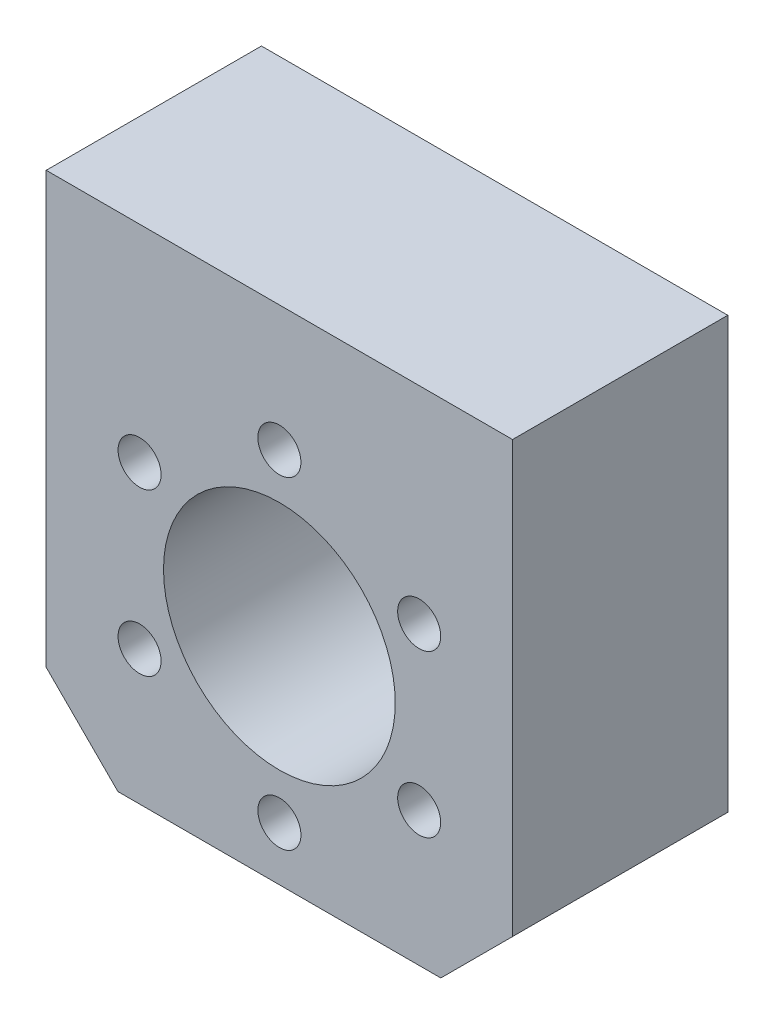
ISO-10303-21;
HEADER;
FILE_DESCRIPTION(('STEP AP214'),'2;1');
FILE_NAME('part.step','',(''),(''),'','','');
FILE_SCHEMA(('AUTOMOTIVE_DESIGN { 1 0 10303 214 1 1 1 1 }'));
ENDSEC;
DATA;
#1=APPLICATION_CONTEXT('core data for automotive mechanical design processes');
#2=APPLICATION_PROTOCOL_DEFINITION('international standard','automotive_design',2000,#1);
#3=PRODUCT_CONTEXT('',#1,'mechanical');
#4=PRODUCT('Part','Part','',(#3));
#5=PRODUCT_RELATED_PRODUCT_CATEGORY('part','',(#4));
#6=PRODUCT_DEFINITION_FORMATION('','',#4);
#7=PRODUCT_DEFINITION_CONTEXT('part definition',#1,'design');
#8=PRODUCT_DEFINITION('design','',#6,#7);
#9=PRODUCT_DEFINITION_SHAPE('','',#8);
#10=(LENGTH_UNIT() NAMED_UNIT(*) SI_UNIT(.MILLI.,.METRE.));
#11=(NAMED_UNIT(*) PLANE_ANGLE_UNIT() SI_UNIT($,.RADIAN.));
#12=(NAMED_UNIT(*) SI_UNIT($,.STERADIAN.) SOLID_ANGLE_UNIT());
#13=UNCERTAINTY_MEASURE_WITH_UNIT(LENGTH_MEASURE(1.E-05),#10,'distance_accuracy_value','');
#14=(GEOMETRIC_REPRESENTATION_CONTEXT(3) GLOBAL_UNCERTAINTY_ASSIGNED_CONTEXT((#13)) GLOBAL_UNIT_ASSIGNED_CONTEXT((#10,
#11,#12)) REPRESENTATION_CONTEXT('',''));
#15=CARTESIAN_POINT('',(0.,0.,0.));
#16=DIRECTION('',(0.,0.,1.));
#17=DIRECTION('',(1.,0.,0.));
#18=AXIS2_PLACEMENT_3D('',#15,#16,#17);
#19=CARTESIAN_POINT('',(12.5283289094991,-24.235127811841,0.));
#20=DIRECTION('',(0.,0.,1.));
#21=DIRECTION('',(1.,0.,0.));
#22=AXIS2_PLACEMENT_3D('',#19,#20,#21);
#23=PLANE('',#22);
#24=CARTESIAN_POINT('',(12.5283289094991,-29.235127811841,0.));
#25=DIRECTION('',(0.,0.,-1.));
#26=DIRECTION('',(-1.,0.,0.));
#27=AXIS2_PLACEMENT_3D('',#24,#25,#26);
#28=CIRCLE('',#27,16.15);
#29=CARTESIAN_POINT('',(-3.62167109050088,-29.235127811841,0.));
#30=VERTEX_POINT('',#29);
#31=EDGE_CURVE('E125',#30,#30,#28,.F.);
#32=ORIENTED_EDGE('',*,*,#31,.T.);
#33=EDGE_LOOP('',(#32));
#34=FACE_BOUND('',#33,.T.);
#35=CARTESIAN_POINT('',(12.5283289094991,-6.73512781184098,0.));
#36=DIRECTION('',(0.,0.,1.));
#37=DIRECTION('',(1.,0.,0.));
#38=AXIS2_PLACEMENT_3D('',#35,#36,#37);
#39=CIRCLE('',#38,3.);
#40=CARTESIAN_POINT('',(15.5283289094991,-6.73512781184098,0.));
#41=VERTEX_POINT('',#40);
#42=EDGE_CURVE('E145',#41,#41,#39,.T.);
#43=ORIENTED_EDGE('',*,*,#42,.T.);
#44=EDGE_LOOP('',(#43));
#45=FACE_BOUND('',#44,.T.);
#46=CARTESIAN_POINT('',(32.013900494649,-17.985127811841,0.));
#47=DIRECTION('',(0.,0.,1.));
#48=DIRECTION('',(1.,0.,0.));
#49=AXIS2_PLACEMENT_3D('',#46,#47,#48);
#50=CIRCLE('',#49,3.);
#51=CARTESIAN_POINT('',(35.013900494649,-17.985127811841,0.));
#52=VERTEX_POINT('',#51);
#53=EDGE_CURVE('E148',#52,#52,#50,.T.);
#54=ORIENTED_EDGE('',*,*,#53,.T.);
#55=EDGE_LOOP('',(#54));
#56=FACE_BOUND('',#55,.T.);
#57=CARTESIAN_POINT('',(-6.95724267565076,-17.985127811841,0.));
#58=DIRECTION('',(0.,0.,1.));
#59=DIRECTION('',(1.,0.,0.));
#60=AXIS2_PLACEMENT_3D('',#57,#58,#59);
#61=CIRCLE('',#60,3.);
#62=CARTESIAN_POINT('',(-3.95724267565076,-17.985127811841,0.));
#63=VERTEX_POINT('',#62);
#64=EDGE_CURVE('E151',#63,#63,#61,.T.);
#65=ORIENTED_EDGE('',*,*,#64,.T.);
#66=EDGE_LOOP('',(#65));
#67=FACE_BOUND('',#66,.T.);
#68=CARTESIAN_POINT('',(-6.95724267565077,-40.485127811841,0.));
#69=DIRECTION('',(0.,0.,1.));
#70=DIRECTION('',(1.,0.,0.));
#71=AXIS2_PLACEMENT_3D('',#68,#69,#70);
#72=CIRCLE('',#71,3.);
#73=CARTESIAN_POINT('',(-3.95724267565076,-40.485127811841,0.));
#74=VERTEX_POINT('',#73);
#75=EDGE_CURVE('E154',#74,#74,#72,.T.);
#76=ORIENTED_EDGE('',*,*,#75,.T.);
#77=EDGE_LOOP('',(#76));
#78=FACE_BOUND('',#77,.T.);
#79=CARTESIAN_POINT('',(12.5283289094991,-51.735127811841,0.));
#80=DIRECTION('',(0.,0.,1.));
#81=DIRECTION('',(1.,0.,0.));
#82=AXIS2_PLACEMENT_3D('',#79,#80,#81);
#83=CIRCLE('',#82,2.99999999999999);
#84=CARTESIAN_POINT('',(15.5283289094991,-51.735127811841,0.));
#85=VERTEX_POINT('',#84);
#86=EDGE_CURVE('E156',#85,#85,#83,.T.);
#87=ORIENTED_EDGE('',*,*,#86,.T.);
#88=EDGE_LOOP('',(#87));
#89=FACE_BOUND('',#88,.T.);
#90=CARTESIAN_POINT('',(32.013900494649,-40.485127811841,0.));
#91=DIRECTION('',(0.,0.,1.));
#92=DIRECTION('',(1.,0.,0.));
#93=AXIS2_PLACEMENT_3D('',#90,#91,#92);
#94=CIRCLE('',#93,3.);
#95=CARTESIAN_POINT('',(35.013900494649,-40.485127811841,0.));
#96=VERTEX_POINT('',#95);
#97=EDGE_CURVE('E20',#96,#96,#94,.T.);
#98=ORIENTED_EDGE('',*,*,#97,.T.);
#99=EDGE_LOOP('',(#98));
#100=FACE_BOUND('',#99,.T.);
#101=DIRECTION('',(1.,0.,0.));
#102=VECTOR('',#101,1.);
#103=CARTESIAN_POINT('',(45.0283289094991,-59.235127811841,0.));
#104=LINE('',#103,#102);
#105=CARTESIAN_POINT('',(-9.97167109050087,-59.235127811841,0.));
#106=VERTEX_POINT('',#105);
#107=CARTESIAN_POINT('',(35.0283289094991,-59.235127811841,0.));
#108=VERTEX_POINT('',#107);
#109=EDGE_CURVE('E107',#106,#108,#104,.T.);
#110=ORIENTED_EDGE('',*,*,#109,.F.);
#111=DIRECTION('',(0.707106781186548,-0.707106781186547,0.));
#112=VECTOR('',#111,1.);
#113=CARTESIAN_POINT('',(-14.9716710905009,-54.235127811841,0.));
#114=LINE('',#113,#112);
#115=CARTESIAN_POINT('',(-19.9716710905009,-49.235127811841,0.));
#116=VERTEX_POINT('',#115);
#117=EDGE_CURVE('E59',#116,#106,#114,.T.);
#118=ORIENTED_EDGE('',*,*,#117,.F.);
#119=DIRECTION('',(0.,1.,0.));
#120=VECTOR('',#119,1.);
#121=CARTESIAN_POINT('',(-19.9716710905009,-59.235127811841,0.));
#122=LINE('',#121,#120);
#123=CARTESIAN_POINT('',(-19.9716710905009,10.764872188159,0.));
#124=VERTEX_POINT('',#123);
#125=EDGE_CURVE('E100',#124,#116,#122,.F.);
#126=ORIENTED_EDGE('',*,*,#125,.F.);
#127=DIRECTION('',(1.,0.,0.));
#128=VECTOR('',#127,1.);
#129=CARTESIAN_POINT('',(-19.9716710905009,10.764872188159,0.));
#130=LINE('',#129,#128);
#131=CARTESIAN_POINT('',(45.0283289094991,10.764872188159,0.));
#132=VERTEX_POINT('',#131);
#133=EDGE_CURVE('E87',#132,#124,#130,.F.);
#134=ORIENTED_EDGE('',*,*,#133,.F.);
#135=DIRECTION('',(0.,1.,0.));
#136=VECTOR('',#135,1.);
#137=CARTESIAN_POINT('',(45.0283289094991,10.764872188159,0.));
#138=LINE('',#137,#136);
#139=CARTESIAN_POINT('',(45.0283289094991,-49.235127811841,0.));
#140=VERTEX_POINT('',#139);
#141=EDGE_CURVE('E85',#140,#132,#138,.T.);
#142=ORIENTED_EDGE('',*,*,#141,.F.);
#143=DIRECTION('',(0.707106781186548,0.707106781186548,0.));
#144=VECTOR('',#143,1.);
#145=CARTESIAN_POINT('',(40.0283289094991,-54.235127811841,0.));
#146=LINE('',#145,#144);
#147=EDGE_CURVE('E74',#108,#140,#146,.T.);
#148=ORIENTED_EDGE('',*,*,#147,.F.);
#149=EDGE_LOOP('',(#110,#118,#126,#134,#142,#148));
#150=FACE_BOUND('',#149,.T.);
#151=ADVANCED_FACE('F16',(#34,#45,#56,#67,#78,#89,#100,#150),#23,.F.);
#152=CARTESIAN_POINT('',(40.0283289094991,-54.235127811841,0.));
#153=DIRECTION('',(0.707106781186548,-0.707106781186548,0.));
#154=DIRECTION('',(0.707106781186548,0.707106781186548,0.));
#155=AXIS2_PLACEMENT_3D('',#152,#153,#154);
#156=PLANE('',#155);
#157=ORIENTED_EDGE('',*,*,#147,.T.);
#158=DIRECTION('',(0.,0.,-1.));
#159=VECTOR('',#158,1.);
#160=CARTESIAN_POINT('',(45.0283289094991,-49.235127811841,0.));
#161=LINE('',#160,#159);
#162=CARTESIAN_POINT('',(45.0283289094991,-49.235127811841,30.));
#163=VERTEX_POINT('',#162);
#164=EDGE_CURVE('E78',#163,#140,#161,.T.);
#165=ORIENTED_EDGE('',*,*,#164,.F.);
#166=DIRECTION('',(0.707106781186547,0.707106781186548,0.));
#167=VECTOR('',#166,1.);
#168=CARTESIAN_POINT('',(35.0283289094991,-59.235127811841,30.));
#169=LINE('',#168,#167);
#170=CARTESIAN_POINT('',(35.0283289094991,-59.235127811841,30.));
#171=VERTEX_POINT('',#170);
#172=EDGE_CURVE('E55',#171,#163,#169,.T.);
#173=ORIENTED_EDGE('',*,*,#172,.F.);
#174=DIRECTION('',(0.,0.,-1.));
#175=VECTOR('',#174,1.);
#176=CARTESIAN_POINT('',(35.0283289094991,-59.235127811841,0.));
#177=LINE('',#176,#175);
#178=EDGE_CURVE('E80',#108,#171,#177,.F.);
#179=ORIENTED_EDGE('',*,*,#178,.F.);
#180=EDGE_LOOP('',(#157,#165,#173,#179));
#181=FACE_BOUND('',#180,.T.);
#182=ADVANCED_FACE('F76',(#181),#156,.T.);
#183=CARTESIAN_POINT('',(45.0283289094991,10.764872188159,0.));
#184=DIRECTION('',(1.,0.,0.));
#185=DIRECTION('',(0.,0.,-1.));
#186=AXIS2_PLACEMENT_3D('',#183,#184,#185);
#187=PLANE('',#186);
#188=DIRECTION('',(0.,0.,1.));
#189=VECTOR('',#188,1.);
#190=CARTESIAN_POINT('',(45.0283289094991,10.764872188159,0.));
#191=LINE('',#190,#189);
#192=CARTESIAN_POINT('',(45.0283289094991,10.764872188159,30.));
#193=VERTEX_POINT('',#192);
#194=EDGE_CURVE('E90',#193,#132,#191,.F.);
#195=ORIENTED_EDGE('',*,*,#194,.F.);
#196=DIRECTION('',(0.,1.,0.));
#197=VECTOR('',#196,1.);
#198=CARTESIAN_POINT('',(45.0283289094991,-24.235127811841,30.));
#199=LINE('',#198,#197);
#200=EDGE_CURVE('E94',#163,#193,#199,.T.);
#201=ORIENTED_EDGE('',*,*,#200,.F.);
#202=ORIENTED_EDGE('',*,*,#164,.T.);
#203=ORIENTED_EDGE('',*,*,#141,.T.);
#204=EDGE_LOOP('',(#195,#201,#202,#203));
#205=FACE_BOUND('',#204,.T.);
#206=ADVANCED_FACE('F92',(#205),#187,.T.);
#207=CARTESIAN_POINT('',(-19.9716710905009,10.764872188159,0.));
#208=DIRECTION('',(0.,1.,0.));
#209=DIRECTION('',(0.,0.,1.));
#210=AXIS2_PLACEMENT_3D('',#207,#208,#209);
#211=PLANE('',#210);
#212=ORIENTED_EDGE('',*,*,#133,.T.);
#213=DIRECTION('',(0.,0.,1.));
#214=VECTOR('',#213,1.);
#215=CARTESIAN_POINT('',(-19.9716710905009,10.764872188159,0.));
#216=LINE('',#215,#214);
#217=CARTESIAN_POINT('',(-19.9716710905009,10.764872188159,30.));
#218=VERTEX_POINT('',#217);
#219=EDGE_CURVE('E98',#218,#124,#216,.F.);
#220=ORIENTED_EDGE('',*,*,#219,.F.);
#221=DIRECTION('',(1.,0.,0.));
#222=VECTOR('',#221,1.);
#223=CARTESIAN_POINT('',(12.5283289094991,10.764872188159,30.));
#224=LINE('',#223,#222);
#225=EDGE_CURVE('E121',#193,#218,#224,.F.);
#226=ORIENTED_EDGE('',*,*,#225,.F.);
#227=ORIENTED_EDGE('',*,*,#194,.T.);
#228=EDGE_LOOP('',(#212,#220,#226,#227));
#229=FACE_BOUND('',#228,.T.);
#230=ADVANCED_FACE('F242',(#229),#211,.T.);
#231=CARTESIAN_POINT('',(-19.9716710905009,-59.235127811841,0.));
#232=DIRECTION('',(-1.,0.,0.));
#233=DIRECTION('',(0.,0.,1.));
#234=AXIS2_PLACEMENT_3D('',#231,#232,#233);
#235=PLANE('',#234);
#236=ORIENTED_EDGE('',*,*,#219,.T.);
#237=ORIENTED_EDGE('',*,*,#125,.T.);
#238=DIRECTION('',(0.,0.,1.));
#239=VECTOR('',#238,1.);
#240=CARTESIAN_POINT('',(-19.9716710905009,-49.235127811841,0.));
#241=LINE('',#240,#239);
#242=CARTESIAN_POINT('',(-19.9716710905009,-49.235127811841,30.));
#243=VERTEX_POINT('',#242);
#244=EDGE_CURVE('E102',#243,#116,#241,.F.);
#245=ORIENTED_EDGE('',*,*,#244,.F.);
#246=DIRECTION('',(0.,1.,0.));
#247=VECTOR('',#246,1.);
#248=CARTESIAN_POINT('',(-19.9716710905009,-24.235127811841,30.));
#249=LINE('',#248,#247);
#250=EDGE_CURVE('E118',#218,#243,#249,.F.);
#251=ORIENTED_EDGE('',*,*,#250,.F.);
#252=EDGE_LOOP('',(#236,#237,#245,#251));
#253=FACE_BOUND('',#252,.T.);
#254=ADVANCED_FACE('F180',(#253),#235,.T.);
#255=CARTESIAN_POINT('',(-14.9716710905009,-54.235127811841,0.));
#256=DIRECTION('',(-0.707106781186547,-0.707106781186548,0.));
#257=DIRECTION('',(0.707106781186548,-0.707106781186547,0.));
#258=AXIS2_PLACEMENT_3D('',#255,#256,#257);
#259=PLANE('',#258);
#260=ORIENTED_EDGE('',*,*,#117,.T.);
#261=DIRECTION('',(0.,0.,-1.));
#262=VECTOR('',#261,1.);
#263=CARTESIAN_POINT('',(-9.97167109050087,-59.235127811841,0.));
#264=LINE('',#263,#262);
#265=CARTESIAN_POINT('',(-9.97167109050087,-59.235127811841,30.));
#266=VERTEX_POINT('',#265);
#267=EDGE_CURVE('E35',#266,#106,#264,.T.);
#268=ORIENTED_EDGE('',*,*,#267,.F.);
#269=DIRECTION('',(0.707106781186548,-0.707106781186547,0.));
#270=VECTOR('',#269,1.);
#271=CARTESIAN_POINT('',(-19.9716710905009,-49.235127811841,30.));
#272=LINE('',#271,#270);
#273=EDGE_CURVE('E115',#243,#266,#272,.T.);
#274=ORIENTED_EDGE('',*,*,#273,.F.);
#275=ORIENTED_EDGE('',*,*,#244,.T.);
#276=EDGE_LOOP('',(#260,#268,#274,#275));
#277=FACE_BOUND('',#276,.T.);
#278=ADVANCED_FACE('F178',(#277),#259,.T.);
#279=CARTESIAN_POINT('',(45.0283289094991,-59.235127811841,0.));
#280=DIRECTION('',(0.,-1.,0.));
#281=DIRECTION('',(0.,0.,-1.));
#282=AXIS2_PLACEMENT_3D('',#279,#280,#281);
#283=PLANE('',#282);
#284=ORIENTED_EDGE('',*,*,#267,.T.);
#285=ORIENTED_EDGE('',*,*,#109,.T.);
#286=ORIENTED_EDGE('',*,*,#178,.T.);
#287=DIRECTION('',(1.,0.,0.));
#288=VECTOR('',#287,1.);
#289=CARTESIAN_POINT('',(12.5283289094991,-59.235127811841,30.));
#290=LINE('',#289,#288);
#291=EDGE_CURVE('E111',#266,#171,#290,.T.);
#292=ORIENTED_EDGE('',*,*,#291,.F.);
#293=EDGE_LOOP('',(#284,#285,#286,#292));
#294=FACE_BOUND('',#293,.T.);
#295=ADVANCED_FACE('F168',(#294),#283,.T.);
#296=CARTESIAN_POINT('',(32.013900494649,-40.485127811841,0.));
#297=DIRECTION('',(0.,0.,1.));
#298=DIRECTION('',(1.,0.,0.));
#299=AXIS2_PLACEMENT_3D('',#296,#297,#298);
#300=CYLINDRICAL_SURFACE('',#299,3.);
#301=ORIENTED_EDGE('',*,*,#97,.F.);
#302=EDGE_LOOP('',(#301));
#303=FACE_BOUND('',#302,.T.);
#304=CARTESIAN_POINT('',(32.013900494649,-40.485127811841,30.));
#305=DIRECTION('',(0.,0.,1.));
#306=DIRECTION('',(1.,0.,0.));
#307=AXIS2_PLACEMENT_3D('',#304,#305,#306);
#308=CIRCLE('',#307,3.);
#309=CARTESIAN_POINT('',(35.013900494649,-40.485127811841,30.));
#310=VERTEX_POINT('',#309);
#311=EDGE_CURVE('E114',#310,#310,#308,.F.);
#312=ORIENTED_EDGE('',*,*,#311,.F.);
#313=EDGE_LOOP('',(#312));
#314=FACE_BOUND('',#313,.T.);
#315=ADVANCED_FACE('F164',(#303,#314),#300,.F.);
#316=CARTESIAN_POINT('',(12.5283289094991,-51.735127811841,0.));
#317=DIRECTION('',(0.,0.,1.));
#318=DIRECTION('',(1.,0.,0.));
#319=AXIS2_PLACEMENT_3D('',#316,#317,#318);
#320=CYLINDRICAL_SURFACE('',#319,2.99999999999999);
#321=ORIENTED_EDGE('',*,*,#86,.F.);
#322=EDGE_LOOP('',(#321));
#323=FACE_BOUND('',#322,.T.);
#324=CARTESIAN_POINT('',(12.5283289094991,-51.735127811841,30.));
#325=DIRECTION('',(0.,0.,1.));
#326=DIRECTION('',(1.,0.,0.));
#327=AXIS2_PLACEMENT_3D('',#324,#325,#326);
#328=CIRCLE('',#327,2.99999999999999);
#329=CARTESIAN_POINT('',(15.5283289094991,-51.735127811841,30.));
#330=VERTEX_POINT('',#329);
#331=EDGE_CURVE('E138',#330,#330,#328,.F.);
#332=ORIENTED_EDGE('',*,*,#331,.F.);
#333=EDGE_LOOP('',(#332));
#334=FACE_BOUND('',#333,.T.);
#335=ADVANCED_FACE('F167',(#323,#334),#320,.F.);
#336=CARTESIAN_POINT('',(-6.95724267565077,-40.485127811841,0.));
#337=DIRECTION('',(0.,0.,1.));
#338=DIRECTION('',(1.,0.,0.));
#339=AXIS2_PLACEMENT_3D('',#336,#337,#338);
#340=CYLINDRICAL_SURFACE('',#339,3.);
#341=ORIENTED_EDGE('',*,*,#75,.F.);
#342=EDGE_LOOP('',(#341));
#343=FACE_BOUND('',#342,.T.);
#344=CARTESIAN_POINT('',(-6.95724267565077,-40.485127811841,30.));
#345=DIRECTION('',(0.,0.,1.));
#346=DIRECTION('',(1.,0.,0.));
#347=AXIS2_PLACEMENT_3D('',#344,#345,#346);
#348=CIRCLE('',#347,3.);
#349=CARTESIAN_POINT('',(-3.95724267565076,-40.485127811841,30.));
#350=VERTEX_POINT('',#349);
#351=EDGE_CURVE('E135',#350,#350,#348,.F.);
#352=ORIENTED_EDGE('',*,*,#351,.F.);
#353=EDGE_LOOP('',(#352));
#354=FACE_BOUND('',#353,.T.);
#355=ADVANCED_FACE('F192',(#343,#354),#340,.F.);
#356=CARTESIAN_POINT('',(-6.95724267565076,-17.985127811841,0.));
#357=DIRECTION('',(0.,0.,1.));
#358=DIRECTION('',(1.,0.,0.));
#359=AXIS2_PLACEMENT_3D('',#356,#357,#358);
#360=CYLINDRICAL_SURFACE('',#359,3.);
#361=ORIENTED_EDGE('',*,*,#64,.F.);
#362=EDGE_LOOP('',(#361));
#363=FACE_BOUND('',#362,.T.);
#364=CARTESIAN_POINT('',(-6.95724267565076,-17.985127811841,30.));
#365=DIRECTION('',(0.,0.,1.));
#366=DIRECTION('',(1.,0.,0.));
#367=AXIS2_PLACEMENT_3D('',#364,#365,#366);
#368=CIRCLE('',#367,3.);
#369=CARTESIAN_POINT('',(-3.95724267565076,-17.985127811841,30.));
#370=VERTEX_POINT('',#369);
#371=EDGE_CURVE('E132',#370,#370,#368,.F.);
#372=ORIENTED_EDGE('',*,*,#371,.F.);
#373=EDGE_LOOP('',(#372));
#374=FACE_BOUND('',#373,.T.);
#375=ADVANCED_FACE('F196',(#363,#374),#360,.F.);
#376=CARTESIAN_POINT('',(32.013900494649,-17.985127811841,0.));
#377=DIRECTION('',(0.,0.,1.));
#378=DIRECTION('',(1.,0.,0.));
#379=AXIS2_PLACEMENT_3D('',#376,#377,#378);
#380=CYLINDRICAL_SURFACE('',#379,3.);
#381=ORIENTED_EDGE('',*,*,#53,.F.);
#382=EDGE_LOOP('',(#381));
#383=FACE_BOUND('',#382,.T.);
#384=CARTESIAN_POINT('',(32.013900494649,-17.985127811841,30.));
#385=DIRECTION('',(0.,0.,1.));
#386=DIRECTION('',(1.,0.,0.));
#387=AXIS2_PLACEMENT_3D('',#384,#385,#386);
#388=CIRCLE('',#387,3.);
#389=CARTESIAN_POINT('',(35.013900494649,-17.985127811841,30.));
#390=VERTEX_POINT('',#389);
#391=EDGE_CURVE('E129',#390,#390,#388,.F.);
#392=ORIENTED_EDGE('',*,*,#391,.F.);
#393=EDGE_LOOP('',(#392));
#394=FACE_BOUND('',#393,.T.);
#395=ADVANCED_FACE('F200',(#383,#394),#380,.F.);
#396=CARTESIAN_POINT('',(12.5283289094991,-6.73512781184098,0.));
#397=DIRECTION('',(0.,0.,1.));
#398=DIRECTION('',(1.,0.,0.));
#399=AXIS2_PLACEMENT_3D('',#396,#397,#398);
#400=CYLINDRICAL_SURFACE('',#399,3.);
#401=ORIENTED_EDGE('',*,*,#42,.F.);
#402=EDGE_LOOP('',(#401));
#403=FACE_BOUND('',#402,.T.);
#404=CARTESIAN_POINT('',(12.5283289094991,-6.73512781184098,30.));
#405=DIRECTION('',(0.,0.,1.));
#406=DIRECTION('',(1.,0.,0.));
#407=AXIS2_PLACEMENT_3D('',#404,#405,#406);
#408=CIRCLE('',#407,3.);
#409=CARTESIAN_POINT('',(15.5283289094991,-6.73512781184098,30.));
#410=VERTEX_POINT('',#409);
#411=EDGE_CURVE('E26',#410,#410,#408,.F.);
#412=ORIENTED_EDGE('',*,*,#411,.F.);
#413=EDGE_LOOP('',(#412));
#414=FACE_BOUND('',#413,.T.);
#415=ADVANCED_FACE('F203',(#403,#414),#400,.F.);
#416=CARTESIAN_POINT('',(12.5283289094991,-29.235127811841,30.));
#417=DIRECTION('',(0.,0.,-1.));
#418=DIRECTION('',(-1.,0.,0.));
#419=AXIS2_PLACEMENT_3D('',#416,#417,#418);
#420=CYLINDRICAL_SURFACE('',#419,16.15);
#421=CARTESIAN_POINT('',(12.5283289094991,-29.235127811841,30.));
#422=DIRECTION('',(0.,0.,-1.));
#423=DIRECTION('',(-1.,0.,0.));
#424=AXIS2_PLACEMENT_3D('',#421,#422,#423);
#425=CIRCLE('',#424,16.15);
#426=CARTESIAN_POINT('',(-3.62167109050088,-29.235127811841,30.));
#427=VERTEX_POINT('',#426);
#428=EDGE_CURVE('E10',#427,#427,#425,.T.);
#429=ORIENTED_EDGE('',*,*,#428,.F.);
#430=EDGE_LOOP('',(#429));
#431=FACE_BOUND('',#430,.T.);
#432=ORIENTED_EDGE('',*,*,#31,.F.);
#433=EDGE_LOOP('',(#432));
#434=FACE_BOUND('',#433,.T.);
#435=ADVANCED_FACE('F18',(#431,#434),#420,.F.);
#436=CARTESIAN_POINT('',(12.5283289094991,-24.235127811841,30.));
#437=DIRECTION('',(0.,0.,1.));
#438=DIRECTION('',(1.,0.,0.));
#439=AXIS2_PLACEMENT_3D('',#436,#437,#438);
#440=PLANE('',#439);
#441=ORIENTED_EDGE('',*,*,#428,.T.);
#442=EDGE_LOOP('',(#441));
#443=FACE_BOUND('',#442,.T.);
#444=ORIENTED_EDGE('',*,*,#411,.T.);
#445=EDGE_LOOP('',(#444));
#446=FACE_BOUND('',#445,.T.);
#447=ORIENTED_EDGE('',*,*,#391,.T.);
#448=EDGE_LOOP('',(#447));
#449=FACE_BOUND('',#448,.T.);
#450=ORIENTED_EDGE('',*,*,#371,.T.);
#451=EDGE_LOOP('',(#450));
#452=FACE_BOUND('',#451,.T.);
#453=ORIENTED_EDGE('',*,*,#351,.T.);
#454=EDGE_LOOP('',(#453));
#455=FACE_BOUND('',#454,.T.);
#456=ORIENTED_EDGE('',*,*,#331,.T.);
#457=EDGE_LOOP('',(#456));
#458=FACE_BOUND('',#457,.T.);
#459=ORIENTED_EDGE('',*,*,#311,.T.);
#460=EDGE_LOOP('',(#459));
#461=FACE_BOUND('',#460,.T.);
#462=ORIENTED_EDGE('',*,*,#273,.T.);
#463=ORIENTED_EDGE('',*,*,#291,.T.);
#464=ORIENTED_EDGE('',*,*,#172,.T.);
#465=ORIENTED_EDGE('',*,*,#200,.T.);
#466=ORIENTED_EDGE('',*,*,#225,.T.);
#467=ORIENTED_EDGE('',*,*,#250,.T.);
#468=EDGE_LOOP('',(#462,#463,#464,#465,#466,#467));
#469=FACE_BOUND('',#468,.T.);
#470=ADVANCED_FACE('F172',(#443,#446,#449,#452,#455,#458,#461,#469),#440,.T.);
#471=CLOSED_SHELL('',(#151,#182,#206,#230,#254,#278,#295,#315,#335,#355,#375,#395,#415,#435,#470));
#472=MANIFOLD_SOLID_BREP('B1',#471);
#473=ADVANCED_BREP_SHAPE_REPRESENTATION('',(#18,#472),#14);
#474=SHAPE_DEFINITION_REPRESENTATION(#9,#473);
ENDSEC;
END-ISO-10303-21;
